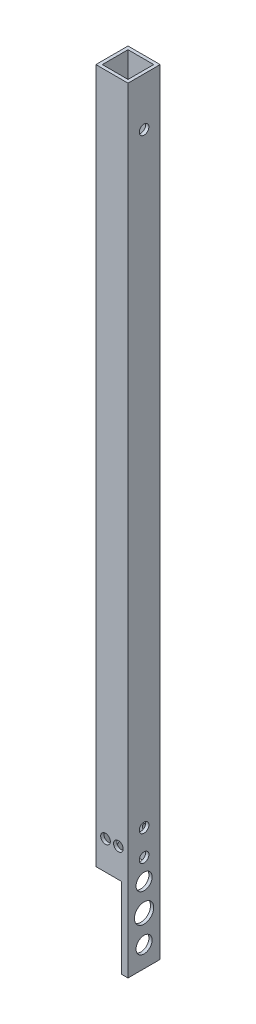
ISO-10303-21;
HEADER;
FILE_DESCRIPTION(('STEP AP214'),'2;1');
FILE_NAME('part.step','',(''),(''),'','','');
FILE_SCHEMA(('AUTOMOTIVE_DESIGN { 1 0 10303 214 1 1 1 1 }'));
ENDSEC;
DATA;
#1=APPLICATION_CONTEXT('core data for automotive mechanical design processes');
#2=APPLICATION_PROTOCOL_DEFINITION('international standard','automotive_design',2000,#1);
#3=PRODUCT_CONTEXT('',#1,'mechanical');
#4=PRODUCT('Part','Part','',(#3));
#5=PRODUCT_RELATED_PRODUCT_CATEGORY('part','',(#4));
#6=PRODUCT_DEFINITION_FORMATION('','',#4);
#7=PRODUCT_DEFINITION_CONTEXT('part definition',#1,'design');
#8=PRODUCT_DEFINITION('design','',#6,#7);
#9=PRODUCT_DEFINITION_SHAPE('','',#8);
#10=(LENGTH_UNIT() NAMED_UNIT(*) SI_UNIT(.MILLI.,.METRE.));
#11=(NAMED_UNIT(*) PLANE_ANGLE_UNIT() SI_UNIT($,.RADIAN.));
#12=(NAMED_UNIT(*) SI_UNIT($,.STERADIAN.) SOLID_ANGLE_UNIT());
#13=UNCERTAINTY_MEASURE_WITH_UNIT(LENGTH_MEASURE(1.E-05),#10,'distance_accuracy_value','');
#14=(GEOMETRIC_REPRESENTATION_CONTEXT(3) GLOBAL_UNCERTAINTY_ASSIGNED_CONTEXT((#13)) GLOBAL_UNIT_ASSIGNED_CONTEXT((#10,
#11,#12)) REPRESENTATION_CONTEXT('',''));
#15=CARTESIAN_POINT('',(0.,0.,0.));
#16=DIRECTION('',(0.,0.,1.));
#17=DIRECTION('',(1.,0.,0.));
#18=AXIS2_PLACEMENT_3D('',#15,#16,#17);
#19=CARTESIAN_POINT('',(0.,0.,0.));
#20=DIRECTION('',(0.,-1.,0.));
#21=DIRECTION('',(0.,0.,-1.));
#22=AXIS2_PLACEMENT_3D('',#19,#20,#21);
#23=PLANE('',#22);
#24=DIRECTION('',(1.,0.,0.));
#25=VECTOR('',#24,1.);
#26=CARTESIAN_POINT('',(-5.,0.,5.));
#27=LINE('',#26,#25);
#28=CARTESIAN_POINT('',(3.,0.,5.));
#29=VERTEX_POINT('',#28);
#30=CARTESIAN_POINT('',(5.,0.,5.));
#31=VERTEX_POINT('',#30);
#32=EDGE_CURVE('E152',#29,#31,#27,.T.);
#33=ORIENTED_EDGE('',*,*,#32,.F.);
#34=DIRECTION('',(0.,0.,1.));
#35=VECTOR('',#34,1.);
#36=CARTESIAN_POINT('',(3.,0.,-5.));
#37=LINE('',#36,#35);
#38=CARTESIAN_POINT('',(3.,0.,4.));
#39=VERTEX_POINT('',#38);
#40=EDGE_CURVE('E135',#39,#29,#37,.T.);
#41=ORIENTED_EDGE('',*,*,#40,.F.);
#42=DIRECTION('',(1.,0.,0.));
#43=VECTOR('',#42,1.);
#44=CARTESIAN_POINT('',(-4.,0.,4.));
#45=LINE('',#44,#43);
#46=CARTESIAN_POINT('',(4.,0.,4.));
#47=VERTEX_POINT('',#46);
#48=EDGE_CURVE('E191',#39,#47,#45,.T.);
#49=ORIENTED_EDGE('',*,*,#48,.T.);
#50=DIRECTION('',(0.,0.,-1.));
#51=VECTOR('',#50,1.);
#52=CARTESIAN_POINT('',(4.,0.,4.));
#53=LINE('',#52,#51);
#54=CARTESIAN_POINT('',(4.,0.,-4.));
#55=VERTEX_POINT('',#54);
#56=EDGE_CURVE('E239',#47,#55,#53,.T.);
#57=ORIENTED_EDGE('',*,*,#56,.T.);
#58=DIRECTION('',(-1.,0.,0.));
#59=VECTOR('',#58,1.);
#60=CARTESIAN_POINT('',(-4.,0.,-4.));
#61=LINE('',#60,#59);
#62=CARTESIAN_POINT('',(3.,0.,-4.));
#63=VERTEX_POINT('',#62);
#64=EDGE_CURVE('E145',#55,#63,#61,.T.);
#65=ORIENTED_EDGE('',*,*,#64,.T.);
#66=CARTESIAN_POINT('',(3.,0.,-5.));
#67=VERTEX_POINT('',#66);
#68=EDGE_CURVE('E127',#67,#63,#37,.T.);
#69=ORIENTED_EDGE('',*,*,#68,.F.);
#70=DIRECTION('',(-1.,0.,0.));
#71=VECTOR('',#70,1.);
#72=CARTESIAN_POINT('',(-5.,0.,-5.));
#73=LINE('',#72,#71);
#74=CARTESIAN_POINT('',(5.,0.,-5.));
#75=VERTEX_POINT('',#74);
#76=EDGE_CURVE('E142',#75,#67,#73,.T.);
#77=ORIENTED_EDGE('',*,*,#76,.F.);
#78=DIRECTION('',(0.,0.,-1.));
#79=VECTOR('',#78,1.);
#80=CARTESIAN_POINT('',(5.,0.,5.));
#81=LINE('',#80,#79);
#82=EDGE_CURVE('E153',#31,#75,#81,.T.);
#83=ORIENTED_EDGE('',*,*,#82,.F.);
#84=EDGE_LOOP('',(#33,#41,#49,#57,#65,#69,#77,#83));
#85=FACE_BOUND('',#84,.T.);
#86=ADVANCED_FACE('F35',(#85),#23,.T.);
#87=CARTESIAN_POINT('',(0.,241.,0.));
#88=DIRECTION('',(0.,-1.,0.));
#89=DIRECTION('',(0.,0.,-1.));
#90=AXIS2_PLACEMENT_3D('',#87,#88,#89);
#91=PLANE('',#90);
#92=DIRECTION('',(0.,0.,-1.));
#93=VECTOR('',#92,1.);
#94=CARTESIAN_POINT('',(5.,241.,5.));
#95=LINE('',#94,#93);
#96=CARTESIAN_POINT('',(5.,241.,5.));
#97=VERTEX_POINT('',#96);
#98=CARTESIAN_POINT('',(5.,241.,-5.));
#99=VERTEX_POINT('',#98);
#100=EDGE_CURVE('E155',#97,#99,#95,.T.);
#101=ORIENTED_EDGE('',*,*,#100,.T.);
#102=DIRECTION('',(-1.,0.,0.));
#103=VECTOR('',#102,1.);
#104=CARTESIAN_POINT('',(-5.,241.,-5.));
#105=LINE('',#104,#103);
#106=CARTESIAN_POINT('',(-5.,241.,-5.));
#107=VERTEX_POINT('',#106);
#108=EDGE_CURVE('E261',#99,#107,#105,.T.);
#109=ORIENTED_EDGE('',*,*,#108,.T.);
#110=DIRECTION('',(0.,0.,1.));
#111=VECTOR('',#110,1.);
#112=CARTESIAN_POINT('',(-5.,241.,5.));
#113=LINE('',#112,#111);
#114=CARTESIAN_POINT('',(-5.,241.,5.));
#115=VERTEX_POINT('',#114);
#116=EDGE_CURVE('E263',#107,#115,#113,.T.);
#117=ORIENTED_EDGE('',*,*,#116,.T.);
#118=DIRECTION('',(1.,0.,0.));
#119=VECTOR('',#118,1.);
#120=CARTESIAN_POINT('',(-5.,241.,5.));
#121=LINE('',#120,#119);
#122=EDGE_CURVE('E165',#115,#97,#121,.T.);
#123=ORIENTED_EDGE('',*,*,#122,.T.);
#124=EDGE_LOOP('',(#101,#109,#117,#123));
#125=FACE_BOUND('',#124,.T.);
#126=DIRECTION('',(0.,0.,-1.));
#127=VECTOR('',#126,1.);
#128=CARTESIAN_POINT('',(4.,241.,4.));
#129=LINE('',#128,#127);
#130=CARTESIAN_POINT('',(4.,241.,4.));
#131=VERTEX_POINT('',#130);
#132=CARTESIAN_POINT('',(4.,241.,-4.));
#133=VERTEX_POINT('',#132);
#134=EDGE_CURVE('E240',#131,#133,#129,.T.);
#135=ORIENTED_EDGE('',*,*,#134,.F.);
#136=DIRECTION('',(1.,0.,0.));
#137=VECTOR('',#136,1.);
#138=CARTESIAN_POINT('',(-4.,241.,4.));
#139=LINE('',#138,#137);
#140=CARTESIAN_POINT('',(-4.,241.,4.));
#141=VERTEX_POINT('',#140);
#142=EDGE_CURVE('E246',#141,#131,#139,.T.);
#143=ORIENTED_EDGE('',*,*,#142,.F.);
#144=DIRECTION('',(0.,0.,1.));
#145=VECTOR('',#144,1.);
#146=CARTESIAN_POINT('',(-4.,241.,4.));
#147=LINE('',#146,#145);
#148=CARTESIAN_POINT('',(-4.,241.,-4.));
#149=VERTEX_POINT('',#148);
#150=EDGE_CURVE('E244',#149,#141,#147,.T.);
#151=ORIENTED_EDGE('',*,*,#150,.F.);
#152=DIRECTION('',(-1.,0.,0.));
#153=VECTOR('',#152,1.);
#154=CARTESIAN_POINT('',(-4.,241.,-4.));
#155=LINE('',#154,#153);
#156=EDGE_CURVE('E242',#133,#149,#155,.T.);
#157=ORIENTED_EDGE('',*,*,#156,.F.);
#158=EDGE_LOOP('',(#135,#143,#151,#157));
#159=FACE_BOUND('',#158,.T.);
#160=ADVANCED_FACE('F267',(#125,#159),#91,.F.);
#161=CARTESIAN_POINT('',(5.,241.,5.));
#162=DIRECTION('',(-1.,0.,0.));
#163=DIRECTION('',(0.,0.,1.));
#164=AXIS2_PLACEMENT_3D('',#161,#162,#163);
#165=PLANE('',#164);
#166=CARTESIAN_POINT('',(5.,23.5,0.));
#167=DIRECTION('',(-1.,0.,0.));
#168=DIRECTION('',(0.,0.,1.));
#169=AXIS2_PLACEMENT_3D('',#166,#167,#168);
#170=CIRCLE('',#169,2.5);
#171=CARTESIAN_POINT('',(5.,23.5,2.5));
#172=VERTEX_POINT('',#171);
#173=EDGE_CURVE('E414',#172,#172,#170,.T.);
#174=ORIENTED_EDGE('',*,*,#173,.T.);
#175=EDGE_LOOP('',(#174));
#176=FACE_BOUND('',#175,.T.);
#177=CARTESIAN_POINT('',(5.,6.49999999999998,0.));
#178=DIRECTION('',(-1.,0.,0.));
#179=DIRECTION('',(0.,0.,1.));
#180=AXIS2_PLACEMENT_3D('',#177,#178,#179);
#181=CIRCLE('',#180,2.5);
#182=CARTESIAN_POINT('',(5.,6.49999999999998,2.5));
#183=VERTEX_POINT('',#182);
#184=EDGE_CURVE('E202',#183,#183,#181,.T.);
#185=ORIENTED_EDGE('',*,*,#184,.T.);
#186=EDGE_LOOP('',(#185));
#187=FACE_BOUND('',#186,.T.);
#188=CARTESIAN_POINT('',(5.,38.,0.));
#189=DIRECTION('',(1.,0.,0.));
#190=DIRECTION('',(0.,0.,-1.));
#191=AXIS2_PLACEMENT_3D('',#188,#189,#190);
#192=CIRCLE('',#191,1.5);
#193=CARTESIAN_POINT('',(5.,38.,-1.5));
#194=VERTEX_POINT('',#193);
#195=EDGE_CURVE('E212',#194,#194,#192,.T.);
#196=ORIENTED_EDGE('',*,*,#195,.F.);
#197=EDGE_LOOP('',(#196));
#198=FACE_BOUND('',#197,.T.);
#199=CARTESIAN_POINT('',(5.,30.,0.));
#200=DIRECTION('',(1.,0.,0.));
#201=DIRECTION('',(0.,0.,-1.));
#202=AXIS2_PLACEMENT_3D('',#199,#200,#201);
#203=CIRCLE('',#202,1.5);
#204=CARTESIAN_POINT('',(5.,30.,-1.5));
#205=VERTEX_POINT('',#204);
#206=EDGE_CURVE('E219',#205,#205,#203,.T.);
#207=ORIENTED_EDGE('',*,*,#206,.F.);
#208=EDGE_LOOP('',(#207));
#209=FACE_BOUND('',#208,.T.);
#210=CARTESIAN_POINT('',(5.,15.,0.));
#211=DIRECTION('',(-1.,0.,0.));
#212=DIRECTION('',(0.,0.,1.));
#213=AXIS2_PLACEMENT_3D('',#210,#211,#212);
#214=CIRCLE('',#213,3.);
#215=CARTESIAN_POINT('',(5.,15.,3.));
#216=VERTEX_POINT('',#215);
#217=EDGE_CURVE('E226',#216,#216,#214,.F.);
#218=ORIENTED_EDGE('',*,*,#217,.F.);
#219=EDGE_LOOP('',(#218));
#220=FACE_BOUND('',#219,.T.);
#221=CARTESIAN_POINT('',(5.,226.,0.));
#222=DIRECTION('',(1.,0.,0.));
#223=DIRECTION('',(0.,0.,-1.));
#224=AXIS2_PLACEMENT_3D('',#221,#222,#223);
#225=CIRCLE('',#224,1.5);
#226=CARTESIAN_POINT('',(5.,226.,-1.5));
#227=VERTEX_POINT('',#226);
#228=EDGE_CURVE('E232',#227,#227,#225,.T.);
#229=ORIENTED_EDGE('',*,*,#228,.F.);
#230=EDGE_LOOP('',(#229));
#231=FACE_BOUND('',#230,.T.);
#232=ORIENTED_EDGE('',*,*,#82,.T.);
#233=DIRECTION('',(0.,-1.,0.));
#234=VECTOR('',#233,1.);
#235=CARTESIAN_POINT('',(5.,241.,-5.));
#236=LINE('',#235,#234);
#237=EDGE_CURVE('E150',#99,#75,#236,.T.);
#238=ORIENTED_EDGE('',*,*,#237,.F.);
#239=ORIENTED_EDGE('',*,*,#100,.F.);
#240=DIRECTION('',(0.,-1.,0.));
#241=VECTOR('',#240,1.);
#242=CARTESIAN_POINT('',(5.,241.,5.));
#243=LINE('',#242,#241);
#244=EDGE_CURVE('E161',#97,#31,#243,.T.);
#245=ORIENTED_EDGE('',*,*,#244,.T.);
#246=EDGE_LOOP('',(#232,#238,#239,#245));
#247=FACE_BOUND('',#246,.T.);
#248=ADVANCED_FACE('F37',(#176,#187,#198,#209,#220,#231,#247),#165,.F.);
#249=CARTESIAN_POINT('',(-5.,241.,-5.));
#250=DIRECTION('',(0.,0.,1.));
#251=DIRECTION('',(1.,0.,0.));
#252=AXIS2_PLACEMENT_3D('',#249,#250,#251);
#253=PLANE('',#252);
#254=CARTESIAN_POINT('',(1.99999999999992,34.,-5.));
#255=DIRECTION('',(0.,0.,1.));
#256=DIRECTION('',(1.,0.,0.));
#257=AXIS2_PLACEMENT_3D('',#254,#255,#256);
#258=CIRCLE('',#257,1.5);
#259=CARTESIAN_POINT('',(3.49999999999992,34.,-5.));
#260=VERTEX_POINT('',#259);
#261=EDGE_CURVE('E391',#260,#260,#258,.T.);
#262=ORIENTED_EDGE('',*,*,#261,.T.);
#263=EDGE_LOOP('',(#262));
#264=FACE_BOUND('',#263,.T.);
#265=CARTESIAN_POINT('',(-2.00000000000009,34.,-5.));
#266=DIRECTION('',(0.,0.,1.));
#267=DIRECTION('',(1.,0.,0.));
#268=AXIS2_PLACEMENT_3D('',#265,#266,#267);
#269=CIRCLE('',#268,1.5);
#270=CARTESIAN_POINT('',(-0.500000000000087,34.,-5.));
#271=VERTEX_POINT('',#270);
#272=EDGE_CURVE('E402',#271,#271,#269,.T.);
#273=ORIENTED_EDGE('',*,*,#272,.T.);
#274=EDGE_LOOP('',(#273));
#275=FACE_BOUND('',#274,.T.);
#276=DIRECTION('',(0.,-1.,0.));
#277=VECTOR('',#276,1.);
#278=CARTESIAN_POINT('',(3.,25.,-5.));
#279=LINE('',#278,#277);
#280=CARTESIAN_POINT('',(3.,25.,-5.));
#281=VERTEX_POINT('',#280);
#282=EDGE_CURVE('E124',#281,#67,#279,.T.);
#283=ORIENTED_EDGE('',*,*,#282,.F.);
#284=DIRECTION('',(-1.,0.,0.));
#285=VECTOR('',#284,1.);
#286=CARTESIAN_POINT('',(3.,25.,-5.));
#287=LINE('',#286,#285);
#288=CARTESIAN_POINT('',(-5.,25.,-5.));
#289=VERTEX_POINT('',#288);
#290=EDGE_CURVE('E203',#281,#289,#287,.T.);
#291=ORIENTED_EDGE('',*,*,#290,.T.);
#292=DIRECTION('',(0.,-1.,0.));
#293=VECTOR('',#292,1.);
#294=CARTESIAN_POINT('',(-5.,241.,-5.));
#295=LINE('',#294,#293);
#296=EDGE_CURVE('E168',#107,#289,#295,.T.);
#297=ORIENTED_EDGE('',*,*,#296,.F.);
#298=ORIENTED_EDGE('',*,*,#108,.F.);
#299=ORIENTED_EDGE('',*,*,#237,.T.);
#300=ORIENTED_EDGE('',*,*,#76,.T.);
#301=EDGE_LOOP('',(#283,#291,#297,#298,#299,#300));
#302=FACE_BOUND('',#301,.T.);
#303=ADVANCED_FACE('F148',(#264,#275,#302),#253,.F.);
#304=CARTESIAN_POINT('',(-5.,241.,5.));
#305=DIRECTION('',(1.,0.,0.));
#306=DIRECTION('',(0.,0.,-1.));
#307=AXIS2_PLACEMENT_3D('',#304,#305,#306);
#308=PLANE('',#307);
#309=CARTESIAN_POINT('',(-5.,38.,0.));
#310=DIRECTION('',(1.,0.,0.));
#311=DIRECTION('',(0.,0.,-1.));
#312=AXIS2_PLACEMENT_3D('',#309,#310,#311);
#313=CIRCLE('',#312,1.5);
#314=CARTESIAN_POINT('',(-5.,38.,-1.5));
#315=VERTEX_POINT('',#314);
#316=EDGE_CURVE('E186',#315,#315,#313,.F.);
#317=ORIENTED_EDGE('',*,*,#316,.F.);
#318=EDGE_LOOP('',(#317));
#319=FACE_BOUND('',#318,.T.);
#320=CARTESIAN_POINT('',(-5.,30.,0.));
#321=DIRECTION('',(1.,0.,0.));
#322=DIRECTION('',(0.,0.,-1.));
#323=AXIS2_PLACEMENT_3D('',#320,#321,#322);
#324=CIRCLE('',#323,1.5);
#325=CARTESIAN_POINT('',(-5.,30.,-1.5));
#326=VERTEX_POINT('',#325);
#327=EDGE_CURVE('E181',#326,#326,#324,.F.);
#328=ORIENTED_EDGE('',*,*,#327,.F.);
#329=EDGE_LOOP('',(#328));
#330=FACE_BOUND('',#329,.T.);
#331=CARTESIAN_POINT('',(-5.,226.,0.));
#332=DIRECTION('',(1.,0.,0.));
#333=DIRECTION('',(0.,0.,-1.));
#334=AXIS2_PLACEMENT_3D('',#331,#332,#333);
#335=CIRCLE('',#334,1.5);
#336=CARTESIAN_POINT('',(-5.,226.,-1.5));
#337=VERTEX_POINT('',#336);
#338=EDGE_CURVE('E176',#337,#337,#335,.F.);
#339=ORIENTED_EDGE('',*,*,#338,.F.);
#340=EDGE_LOOP('',(#339));
#341=FACE_BOUND('',#340,.T.);
#342=ORIENTED_EDGE('',*,*,#296,.T.);
#343=DIRECTION('',(0.,0.,-1.));
#344=VECTOR('',#343,1.);
#345=CARTESIAN_POINT('',(-5.,25.,-5.));
#346=LINE('',#345,#344);
#347=CARTESIAN_POINT('',(-5.,25.,5.));
#348=VERTEX_POINT('',#347);
#349=EDGE_CURVE('E136',#348,#289,#346,.T.);
#350=ORIENTED_EDGE('',*,*,#349,.F.);
#351=DIRECTION('',(0.,-1.,0.));
#352=VECTOR('',#351,1.);
#353=CARTESIAN_POINT('',(-5.,241.,5.));
#354=LINE('',#353,#352);
#355=EDGE_CURVE('E164',#115,#348,#354,.T.);
#356=ORIENTED_EDGE('',*,*,#355,.F.);
#357=ORIENTED_EDGE('',*,*,#116,.F.);
#358=EDGE_LOOP('',(#342,#350,#356,#357));
#359=FACE_BOUND('',#358,.T.);
#360=ADVANCED_FACE('F281',(#319,#330,#341,#359),#308,.F.);
#361=CARTESIAN_POINT('',(-5.,241.,5.));
#362=DIRECTION('',(0.,0.,-1.));
#363=DIRECTION('',(-1.,0.,0.));
#364=AXIS2_PLACEMENT_3D('',#361,#362,#363);
#365=PLANE('',#364);
#366=CARTESIAN_POINT('',(1.99999999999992,34.,5.));
#367=DIRECTION('',(0.,0.,1.));
#368=DIRECTION('',(1.,0.,0.));
#369=AXIS2_PLACEMENT_3D('',#366,#367,#368);
#370=CIRCLE('',#369,1.5);
#371=CARTESIAN_POINT('',(3.49999999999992,34.,5.));
#372=VERTEX_POINT('',#371);
#373=EDGE_CURVE('E390',#372,#372,#370,.T.);
#374=ORIENTED_EDGE('',*,*,#373,.F.);
#375=EDGE_LOOP('',(#374));
#376=FACE_BOUND('',#375,.T.);
#377=CARTESIAN_POINT('',(-2.00000000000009,34.,5.));
#378=DIRECTION('',(0.,0.,1.));
#379=DIRECTION('',(1.,0.,0.));
#380=AXIS2_PLACEMENT_3D('',#377,#378,#379);
#381=CIRCLE('',#380,1.5);
#382=CARTESIAN_POINT('',(-0.500000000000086,34.,5.));
#383=VERTEX_POINT('',#382);
#384=EDGE_CURVE('E399',#383,#383,#381,.T.);
#385=ORIENTED_EDGE('',*,*,#384,.F.);
#386=EDGE_LOOP('',(#385));
#387=FACE_BOUND('',#386,.T.);
#388=ORIENTED_EDGE('',*,*,#355,.T.);
#389=DIRECTION('',(-1.,0.,0.));
#390=VECTOR('',#389,1.);
#391=CARTESIAN_POINT('',(3.,25.,5.));
#392=LINE('',#391,#390);
#393=CARTESIAN_POINT('',(3.,25.,5.));
#394=VERTEX_POINT('',#393);
#395=EDGE_CURVE('E200',#394,#348,#392,.T.);
#396=ORIENTED_EDGE('',*,*,#395,.F.);
#397=DIRECTION('',(0.,1.,0.));
#398=VECTOR('',#397,1.);
#399=CARTESIAN_POINT('',(3.,25.,5.));
#400=LINE('',#399,#398);
#401=EDGE_CURVE('E146',#29,#394,#400,.T.);
#402=ORIENTED_EDGE('',*,*,#401,.F.);
#403=ORIENTED_EDGE('',*,*,#32,.T.);
#404=ORIENTED_EDGE('',*,*,#244,.F.);
#405=ORIENTED_EDGE('',*,*,#122,.F.);
#406=EDGE_LOOP('',(#388,#396,#402,#403,#404,#405));
#407=FACE_BOUND('',#406,.T.);
#408=ADVANCED_FACE('F273',(#376,#387,#407),#365,.F.);
#409=CARTESIAN_POINT('',(4.,241.,4.));
#410=DIRECTION('',(-1.,0.,0.));
#411=DIRECTION('',(0.,0.,1.));
#412=AXIS2_PLACEMENT_3D('',#409,#410,#411);
#413=PLANE('',#412);
#414=CARTESIAN_POINT('',(4.,23.5,0.));
#415=DIRECTION('',(-1.,0.,0.));
#416=DIRECTION('',(0.,0.,1.));
#417=AXIS2_PLACEMENT_3D('',#414,#415,#416);
#418=CIRCLE('',#417,2.49999999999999);
#419=CARTESIAN_POINT('',(4.,23.5,2.49999999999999));
#420=VERTEX_POINT('',#419);
#421=EDGE_CURVE('E411',#420,#420,#418,.T.);
#422=ORIENTED_EDGE('',*,*,#421,.F.);
#423=EDGE_LOOP('',(#422));
#424=FACE_BOUND('',#423,.T.);
#425=CARTESIAN_POINT('',(4.,6.49999999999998,0.));
#426=DIRECTION('',(-1.,0.,0.));
#427=DIRECTION('',(0.,0.,1.));
#428=AXIS2_PLACEMENT_3D('',#425,#426,#427);
#429=CIRCLE('',#428,2.49999999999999);
#430=CARTESIAN_POINT('',(4.,6.49999999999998,2.49999999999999));
#431=VERTEX_POINT('',#430);
#432=EDGE_CURVE('E416',#431,#431,#429,.T.);
#433=ORIENTED_EDGE('',*,*,#432,.F.);
#434=EDGE_LOOP('',(#433));
#435=FACE_BOUND('',#434,.T.);
#436=CARTESIAN_POINT('',(4.,38.,0.));
#437=DIRECTION('',(-1.,0.,0.));
#438=DIRECTION('',(0.,0.,1.));
#439=AXIS2_PLACEMENT_3D('',#436,#437,#438);
#440=CIRCLE('',#439,1.5);
#441=CARTESIAN_POINT('',(4.,38.,1.5));
#442=VERTEX_POINT('',#441);
#443=EDGE_CURVE('E185',#442,#442,#440,.T.);
#444=ORIENTED_EDGE('',*,*,#443,.F.);
#445=EDGE_LOOP('',(#444));
#446=FACE_BOUND('',#445,.T.);
#447=CARTESIAN_POINT('',(4.,30.,0.));
#448=DIRECTION('',(-1.,0.,0.));
#449=DIRECTION('',(0.,0.,1.));
#450=AXIS2_PLACEMENT_3D('',#447,#448,#449);
#451=CIRCLE('',#450,1.5);
#452=CARTESIAN_POINT('',(4.,30.,1.5));
#453=VERTEX_POINT('',#452);
#454=EDGE_CURVE('E180',#453,#453,#451,.T.);
#455=ORIENTED_EDGE('',*,*,#454,.F.);
#456=EDGE_LOOP('',(#455));
#457=FACE_BOUND('',#456,.T.);
#458=CARTESIAN_POINT('',(4.,15.,0.));
#459=DIRECTION('',(-1.,0.,0.));
#460=DIRECTION('',(0.,0.,1.));
#461=AXIS2_PLACEMENT_3D('',#458,#459,#460);
#462=CIRCLE('',#461,3.);
#463=CARTESIAN_POINT('',(4.,15.,3.));
#464=VERTEX_POINT('',#463);
#465=EDGE_CURVE('E229',#464,#464,#462,.T.);
#466=ORIENTED_EDGE('',*,*,#465,.F.);
#467=EDGE_LOOP('',(#466));
#468=FACE_BOUND('',#467,.T.);
#469=CARTESIAN_POINT('',(4.,226.,0.));
#470=DIRECTION('',(-1.,0.,0.));
#471=DIRECTION('',(0.,0.,1.));
#472=AXIS2_PLACEMENT_3D('',#469,#470,#471);
#473=CIRCLE('',#472,1.5);
#474=CARTESIAN_POINT('',(4.,226.,1.5));
#475=VERTEX_POINT('',#474);
#476=EDGE_CURVE('E175',#475,#475,#473,.T.);
#477=ORIENTED_EDGE('',*,*,#476,.F.);
#478=EDGE_LOOP('',(#477));
#479=FACE_BOUND('',#478,.T.);
#480=ORIENTED_EDGE('',*,*,#56,.F.);
#481=DIRECTION('',(0.,-1.,0.));
#482=VECTOR('',#481,1.);
#483=CARTESIAN_POINT('',(4.,241.,4.));
#484=LINE('',#483,#482);
#485=EDGE_CURVE('E248',#131,#47,#484,.T.);
#486=ORIENTED_EDGE('',*,*,#485,.F.);
#487=ORIENTED_EDGE('',*,*,#134,.T.);
#488=DIRECTION('',(0.,-1.,0.));
#489=VECTOR('',#488,1.);
#490=CARTESIAN_POINT('',(4.,241.,-4.));
#491=LINE('',#490,#489);
#492=EDGE_CURVE('E157',#133,#55,#491,.T.);
#493=ORIENTED_EDGE('',*,*,#492,.T.);
#494=EDGE_LOOP('',(#480,#486,#487,#493));
#495=FACE_BOUND('',#494,.T.);
#496=ADVANCED_FACE('F294',(#424,#435,#446,#457,#468,#479,#495),#413,.T.);
#497=CARTESIAN_POINT('',(-4.,241.,-4.));
#498=DIRECTION('',(0.,0.,1.));
#499=DIRECTION('',(1.,0.,0.));
#500=AXIS2_PLACEMENT_3D('',#497,#498,#499);
#501=PLANE('',#500);
#502=CARTESIAN_POINT('',(1.99999999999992,34.,-4.));
#503=DIRECTION('',(0.,0.,1.));
#504=DIRECTION('',(1.,0.,0.));
#505=AXIS2_PLACEMENT_3D('',#502,#503,#504);
#506=CIRCLE('',#505,1.5);
#507=CARTESIAN_POINT('',(3.49999999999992,34.,-4.));
#508=VERTEX_POINT('',#507);
#509=EDGE_CURVE('E396',#508,#508,#506,.T.);
#510=ORIENTED_EDGE('',*,*,#509,.F.);
#511=EDGE_LOOP('',(#510));
#512=FACE_BOUND('',#511,.T.);
#513=CARTESIAN_POINT('',(-2.00000000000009,34.,-4.));
#514=DIRECTION('',(0.,0.,1.));
#515=DIRECTION('',(1.,0.,0.));
#516=AXIS2_PLACEMENT_3D('',#513,#514,#515);
#517=CIRCLE('',#516,1.5);
#518=CARTESIAN_POINT('',(-0.500000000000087,34.,-4.));
#519=VERTEX_POINT('',#518);
#520=EDGE_CURVE('E405',#519,#519,#517,.T.);
#521=ORIENTED_EDGE('',*,*,#520,.F.);
#522=EDGE_LOOP('',(#521));
#523=FACE_BOUND('',#522,.T.);
#524=DIRECTION('',(-1.,0.,0.));
#525=VECTOR('',#524,1.);
#526=CARTESIAN_POINT('',(-4.,25.,-4.));
#527=LINE('',#526,#525);
#528=CARTESIAN_POINT('',(3.,25.,-4.));
#529=VERTEX_POINT('',#528);
#530=CARTESIAN_POINT('',(-4.,25.,-4.));
#531=VERTEX_POINT('',#530);
#532=EDGE_CURVE('E210',#529,#531,#527,.T.);
#533=ORIENTED_EDGE('',*,*,#532,.F.);
#534=DIRECTION('',(0.,-1.,0.));
#535=VECTOR('',#534,1.);
#536=CARTESIAN_POINT('',(3.,241.,-4.));
#537=LINE('',#536,#535);
#538=EDGE_CURVE('E205',#529,#63,#537,.T.);
#539=ORIENTED_EDGE('',*,*,#538,.T.);
#540=ORIENTED_EDGE('',*,*,#64,.F.);
#541=ORIENTED_EDGE('',*,*,#492,.F.);
#542=ORIENTED_EDGE('',*,*,#156,.T.);
#543=DIRECTION('',(0.,-1.,0.));
#544=VECTOR('',#543,1.);
#545=CARTESIAN_POINT('',(-4.,241.,-4.));
#546=LINE('',#545,#544);
#547=EDGE_CURVE('E254',#149,#531,#546,.T.);
#548=ORIENTED_EDGE('',*,*,#547,.T.);
#549=EDGE_LOOP('',(#533,#539,#540,#541,#542,#548));
#550=FACE_BOUND('',#549,.T.);
#551=ADVANCED_FACE('F319',(#512,#523,#550),#501,.T.);
#552=CARTESIAN_POINT('',(-4.,241.,4.));
#553=DIRECTION('',(1.,0.,0.));
#554=DIRECTION('',(0.,0.,-1.));
#555=AXIS2_PLACEMENT_3D('',#552,#553,#554);
#556=PLANE('',#555);
#557=DIRECTION('',(0.,0.,1.));
#558=VECTOR('',#557,1.);
#559=CARTESIAN_POINT('',(-4.,25.,3.99999999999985));
#560=LINE('',#559,#558);
#561=CARTESIAN_POINT('',(-4.,25.,4.));
#562=VERTEX_POINT('',#561);
#563=EDGE_CURVE('E208',#531,#562,#560,.T.);
#564=ORIENTED_EDGE('',*,*,#563,.F.);
#565=ORIENTED_EDGE('',*,*,#547,.F.);
#566=ORIENTED_EDGE('',*,*,#150,.T.);
#567=DIRECTION('',(0.,-1.,0.));
#568=VECTOR('',#567,1.);
#569=CARTESIAN_POINT('',(-4.,241.,4.));
#570=LINE('',#569,#568);
#571=EDGE_CURVE('E58',#141,#562,#570,.T.);
#572=ORIENTED_EDGE('',*,*,#571,.T.);
#573=EDGE_LOOP('',(#564,#565,#566,#572));
#574=FACE_BOUND('',#573,.T.);
#575=CARTESIAN_POINT('',(-4.,38.,0.));
#576=DIRECTION('',(1.,0.,0.));
#577=DIRECTION('',(0.,0.,-1.));
#578=AXIS2_PLACEMENT_3D('',#575,#576,#577);
#579=CIRCLE('',#578,1.5);
#580=CARTESIAN_POINT('',(-4.,38.,-1.5));
#581=VERTEX_POINT('',#580);
#582=EDGE_CURVE('E182',#581,#581,#579,.T.);
#583=ORIENTED_EDGE('',*,*,#582,.F.);
#584=EDGE_LOOP('',(#583));
#585=FACE_BOUND('',#584,.T.);
#586=CARTESIAN_POINT('',(-4.,30.,0.));
#587=DIRECTION('',(1.,0.,0.));
#588=DIRECTION('',(0.,0.,-1.));
#589=AXIS2_PLACEMENT_3D('',#586,#587,#588);
#590=CIRCLE('',#589,1.5);
#591=CARTESIAN_POINT('',(-4.,30.,-1.5));
#592=VERTEX_POINT('',#591);
#593=EDGE_CURVE('E177',#592,#592,#590,.T.);
#594=ORIENTED_EDGE('',*,*,#593,.F.);
#595=EDGE_LOOP('',(#594));
#596=FACE_BOUND('',#595,.T.);
#597=CARTESIAN_POINT('',(-4.,226.,0.));
#598=DIRECTION('',(1.,0.,0.));
#599=DIRECTION('',(0.,0.,-1.));
#600=AXIS2_PLACEMENT_3D('',#597,#598,#599);
#601=CIRCLE('',#600,1.5);
#602=CARTESIAN_POINT('',(-4.,226.,-1.5));
#603=VERTEX_POINT('',#602);
#604=EDGE_CURVE('E172',#603,#603,#601,.T.);
#605=ORIENTED_EDGE('',*,*,#604,.F.);
#606=EDGE_LOOP('',(#605));
#607=FACE_BOUND('',#606,.T.);
#608=ADVANCED_FACE('F315',(#574,#585,#596,#607),#556,.T.);
#609=CARTESIAN_POINT('',(-4.,241.,4.));
#610=DIRECTION('',(0.,0.,-1.));
#611=DIRECTION('',(-1.,0.,0.));
#612=AXIS2_PLACEMENT_3D('',#609,#610,#611);
#613=PLANE('',#612);
#614=CARTESIAN_POINT('',(1.99999999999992,34.,4.));
#615=DIRECTION('',(0.,0.,-1.));
#616=DIRECTION('',(-1.,0.,0.));
#617=AXIS2_PLACEMENT_3D('',#614,#615,#616);
#618=CIRCLE('',#617,1.5);
#619=CARTESIAN_POINT('',(0.49999999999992,34.,4.));
#620=VERTEX_POINT('',#619);
#621=EDGE_CURVE('E39',#620,#620,#618,.T.);
#622=ORIENTED_EDGE('',*,*,#621,.F.);
#623=EDGE_LOOP('',(#622));
#624=FACE_BOUND('',#623,.T.);
#625=CARTESIAN_POINT('',(-2.00000000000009,34.,4.));
#626=DIRECTION('',(0.,0.,-1.));
#627=DIRECTION('',(-1.,0.,0.));
#628=AXIS2_PLACEMENT_3D('',#625,#626,#627);
#629=CIRCLE('',#628,1.5);
#630=CARTESIAN_POINT('',(-3.50000000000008,34.,4.));
#631=VERTEX_POINT('',#630);
#632=EDGE_CURVE('E408',#631,#631,#629,.T.);
#633=ORIENTED_EDGE('',*,*,#632,.F.);
#634=EDGE_LOOP('',(#633));
#635=FACE_BOUND('',#634,.T.);
#636=DIRECTION('',(1.,0.,0.));
#637=VECTOR('',#636,1.);
#638=CARTESIAN_POINT('',(-4.,25.,4.));
#639=LINE('',#638,#637);
#640=CARTESIAN_POINT('',(3.,25.,4.));
#641=VERTEX_POINT('',#640);
#642=EDGE_CURVE('E11',#562,#641,#639,.T.);
#643=ORIENTED_EDGE('',*,*,#642,.F.);
#644=ORIENTED_EDGE('',*,*,#571,.F.);
#645=ORIENTED_EDGE('',*,*,#142,.T.);
#646=ORIENTED_EDGE('',*,*,#485,.T.);
#647=ORIENTED_EDGE('',*,*,#48,.F.);
#648=DIRECTION('',(0.,1.,0.));
#649=VECTOR('',#648,1.);
#650=CARTESIAN_POINT('',(3.,241.,4.));
#651=LINE('',#650,#649);
#652=EDGE_CURVE('E44',#39,#641,#651,.T.);
#653=ORIENTED_EDGE('',*,*,#652,.T.);
#654=EDGE_LOOP('',(#643,#644,#645,#646,#647,#653));
#655=FACE_BOUND('',#654,.T.);
#656=ADVANCED_FACE('F189',(#624,#635,#655),#613,.T.);
#657=CARTESIAN_POINT('',(-9.24264068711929,226.,0.));
#658=DIRECTION('',(1.,0.,0.));
#659=DIRECTION('',(0.,0.,-1.));
#660=AXIS2_PLACEMENT_3D('',#657,#658,#659);
#661=CYLINDRICAL_SURFACE('',#660,1.5);
#662=ORIENTED_EDGE('',*,*,#604,.T.);
#663=EDGE_LOOP('',(#662));
#664=FACE_BOUND('',#663,.T.);
#665=ORIENTED_EDGE('',*,*,#338,.T.);
#666=EDGE_LOOP('',(#665));
#667=FACE_BOUND('',#666,.T.);
#668=ADVANCED_FACE('F340',(#664,#667),#661,.F.);
#669=ORIENTED_EDGE('',*,*,#476,.T.);
#670=EDGE_LOOP('',(#669));
#671=FACE_BOUND('',#670,.T.);
#672=ORIENTED_EDGE('',*,*,#228,.T.);
#673=EDGE_LOOP('',(#672));
#674=FACE_BOUND('',#673,.T.);
#675=ADVANCED_FACE('F344',(#671,#674),#661,.F.);
#676=CARTESIAN_POINT('',(13.4852813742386,15.,0.));
#677=DIRECTION('',(-1.,0.,0.));
#678=DIRECTION('',(0.,0.,1.));
#679=AXIS2_PLACEMENT_3D('',#676,#677,#678);
#680=CYLINDRICAL_SURFACE('',#679,3.);
#681=ORIENTED_EDGE('',*,*,#465,.T.);
#682=EDGE_LOOP('',(#681));
#683=FACE_BOUND('',#682,.T.);
#684=ORIENTED_EDGE('',*,*,#217,.T.);
#685=EDGE_LOOP('',(#684));
#686=FACE_BOUND('',#685,.T.);
#687=ADVANCED_FACE('F346',(#683,#686),#680,.F.);
#688=CARTESIAN_POINT('',(-9.24264068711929,30.,0.));
#689=DIRECTION('',(1.,0.,0.));
#690=DIRECTION('',(0.,0.,-1.));
#691=AXIS2_PLACEMENT_3D('',#688,#689,#690);
#692=CYLINDRICAL_SURFACE('',#691,1.5);
#693=ORIENTED_EDGE('',*,*,#593,.T.);
#694=EDGE_LOOP('',(#693));
#695=FACE_BOUND('',#694,.T.);
#696=ORIENTED_EDGE('',*,*,#327,.T.);
#697=EDGE_LOOP('',(#696));
#698=FACE_BOUND('',#697,.T.);
#699=ADVANCED_FACE('F349',(#695,#698),#692,.F.);
#700=ORIENTED_EDGE('',*,*,#454,.T.);
#701=EDGE_LOOP('',(#700));
#702=FACE_BOUND('',#701,.T.);
#703=ORIENTED_EDGE('',*,*,#206,.T.);
#704=EDGE_LOOP('',(#703));
#705=FACE_BOUND('',#704,.T.);
#706=ADVANCED_FACE('F353',(#702,#705),#692,.F.);
#707=CARTESIAN_POINT('',(-9.24264068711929,38.,0.));
#708=DIRECTION('',(1.,0.,0.));
#709=DIRECTION('',(0.,0.,-1.));
#710=AXIS2_PLACEMENT_3D('',#707,#708,#709);
#711=CYLINDRICAL_SURFACE('',#710,1.5);
#712=ORIENTED_EDGE('',*,*,#582,.T.);
#713=EDGE_LOOP('',(#712));
#714=FACE_BOUND('',#713,.T.);
#715=ORIENTED_EDGE('',*,*,#316,.T.);
#716=EDGE_LOOP('',(#715));
#717=FACE_BOUND('',#716,.T.);
#718=ADVANCED_FACE('F355',(#714,#717),#711,.F.);
#719=ORIENTED_EDGE('',*,*,#443,.T.);
#720=EDGE_LOOP('',(#719));
#721=FACE_BOUND('',#720,.T.);
#722=ORIENTED_EDGE('',*,*,#195,.T.);
#723=EDGE_LOOP('',(#722));
#724=FACE_BOUND('',#723,.T.);
#725=ADVANCED_FACE('F358',(#721,#724),#711,.F.);
#726=CARTESIAN_POINT('',(3.,0.,0.));
#727=DIRECTION('',(-1.,0.,0.));
#728=DIRECTION('',(0.,0.,1.));
#729=AXIS2_PLACEMENT_3D('',#726,#727,#728);
#730=PLANE('',#729);
#731=DIRECTION('',(0.,0.,-1.));
#732=VECTOR('',#731,1.);
#733=CARTESIAN_POINT('',(3.,25.,-5.));
#734=LINE('',#733,#732);
#735=EDGE_CURVE('E130',#529,#281,#734,.T.);
#736=ORIENTED_EDGE('',*,*,#735,.T.);
#737=ORIENTED_EDGE('',*,*,#282,.T.);
#738=ORIENTED_EDGE('',*,*,#68,.T.);
#739=ORIENTED_EDGE('',*,*,#538,.F.);
#740=EDGE_LOOP('',(#736,#737,#738,#739));
#741=FACE_BOUND('',#740,.T.);
#742=ADVANCED_FACE('F126',(#741),#730,.T.);
#743=CARTESIAN_POINT('',(3.,25.,-5.));
#744=DIRECTION('',(0.,1.,0.));
#745=DIRECTION('',(0.,0.,1.));
#746=AXIS2_PLACEMENT_3D('',#743,#744,#745);
#747=PLANE('',#746);
#748=ORIENTED_EDGE('',*,*,#532,.T.);
#749=ORIENTED_EDGE('',*,*,#563,.T.);
#750=ORIENTED_EDGE('',*,*,#642,.T.);
#751=EDGE_CURVE('E51',#394,#641,#734,.T.);
#752=ORIENTED_EDGE('',*,*,#751,.F.);
#753=ORIENTED_EDGE('',*,*,#395,.T.);
#754=ORIENTED_EDGE('',*,*,#349,.T.);
#755=ORIENTED_EDGE('',*,*,#290,.F.);
#756=ORIENTED_EDGE('',*,*,#735,.F.);
#757=EDGE_LOOP('',(#748,#749,#750,#752,#753,#754,#755,#756));
#758=FACE_BOUND('',#757,.T.);
#759=ADVANCED_FACE('F309',(#758),#747,.F.);
#760=ORIENTED_EDGE('',*,*,#40,.T.);
#761=ORIENTED_EDGE('',*,*,#401,.T.);
#762=ORIENTED_EDGE('',*,*,#751,.T.);
#763=ORIENTED_EDGE('',*,*,#652,.F.);
#764=EDGE_LOOP('',(#760,#761,#762,#763));
#765=FACE_BOUND('',#764,.T.);
#766=ADVANCED_FACE('F193',(#765),#730,.T.);
#767=CARTESIAN_POINT('',(4.,6.49999999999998,0.));
#768=DIRECTION('',(-1.,0.,0.));
#769=DIRECTION('',(0.,0.,1.));
#770=AXIS2_PLACEMENT_3D('',#767,#768,#769);
#771=CYLINDRICAL_SURFACE('',#770,2.49999999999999);
#772=ORIENTED_EDGE('',*,*,#184,.F.);
#773=EDGE_LOOP('',(#772));
#774=FACE_BOUND('',#773,.T.);
#775=ORIENTED_EDGE('',*,*,#432,.T.);
#776=EDGE_LOOP('',(#775));
#777=FACE_BOUND('',#776,.T.);
#778=ADVANCED_FACE('F364',(#774,#777),#771,.F.);
#779=CARTESIAN_POINT('',(4.,23.5,0.));
#780=DIRECTION('',(-1.,0.,0.));
#781=DIRECTION('',(0.,0.,1.));
#782=AXIS2_PLACEMENT_3D('',#779,#780,#781);
#783=CYLINDRICAL_SURFACE('',#782,2.49999999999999);
#784=ORIENTED_EDGE('',*,*,#173,.F.);
#785=EDGE_LOOP('',(#784));
#786=FACE_BOUND('',#785,.T.);
#787=ORIENTED_EDGE('',*,*,#421,.T.);
#788=EDGE_LOOP('',(#787));
#789=FACE_BOUND('',#788,.T.);
#790=ADVANCED_FACE('F367',(#786,#789),#783,.F.);
#791=CARTESIAN_POINT('',(-2.00000000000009,34.,5.));
#792=DIRECTION('',(0.,0.,1.));
#793=DIRECTION('',(1.,0.,0.));
#794=AXIS2_PLACEMENT_3D('',#791,#792,#793);
#795=CYLINDRICAL_SURFACE('',#794,1.5);
#796=ORIENTED_EDGE('',*,*,#632,.T.);
#797=EDGE_LOOP('',(#796));
#798=FACE_BOUND('',#797,.T.);
#799=ORIENTED_EDGE('',*,*,#384,.T.);
#800=EDGE_LOOP('',(#799));
#801=FACE_BOUND('',#800,.T.);
#802=ADVANCED_FACE('F371',(#798,#801),#795,.F.);
#803=ORIENTED_EDGE('',*,*,#520,.T.);
#804=EDGE_LOOP('',(#803));
#805=FACE_BOUND('',#804,.T.);
#806=ORIENTED_EDGE('',*,*,#272,.F.);
#807=EDGE_LOOP('',(#806));
#808=FACE_BOUND('',#807,.T.);
#809=ADVANCED_FACE('F373',(#805,#808),#795,.F.);
#810=CARTESIAN_POINT('',(1.99999999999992,34.,5.));
#811=DIRECTION('',(0.,0.,1.));
#812=DIRECTION('',(1.,0.,0.));
#813=AXIS2_PLACEMENT_3D('',#810,#811,#812);
#814=CYLINDRICAL_SURFACE('',#813,1.5);
#815=ORIENTED_EDGE('',*,*,#621,.T.);
#816=EDGE_LOOP('',(#815));
#817=FACE_BOUND('',#816,.T.);
#818=ORIENTED_EDGE('',*,*,#373,.T.);
#819=EDGE_LOOP('',(#818));
#820=FACE_BOUND('',#819,.T.);
#821=ADVANCED_FACE('F376',(#817,#820),#814,.F.);
#822=ORIENTED_EDGE('',*,*,#509,.T.);
#823=EDGE_LOOP('',(#822));
#824=FACE_BOUND('',#823,.T.);
#825=ORIENTED_EDGE('',*,*,#261,.F.);
#826=EDGE_LOOP('',(#825));
#827=FACE_BOUND('',#826,.T.);
#828=ADVANCED_FACE('F379',(#824,#827),#814,.F.);
#829=CLOSED_SHELL('',(#86,#160,#248,#303,#360,#408,#496,#551,#608,#656,#668,#675,#687,#699,#706,
#718,#725,#742,#759,#766,#778,#790,#802,#809,#821,#828));
#830=MANIFOLD_SOLID_BREP('B2',#829);
#831=ADVANCED_BREP_SHAPE_REPRESENTATION('',(#18,#830),#14);
#832=SHAPE_DEFINITION_REPRESENTATION(#9,#831);
ENDSEC;
END-ISO-10303-21;
